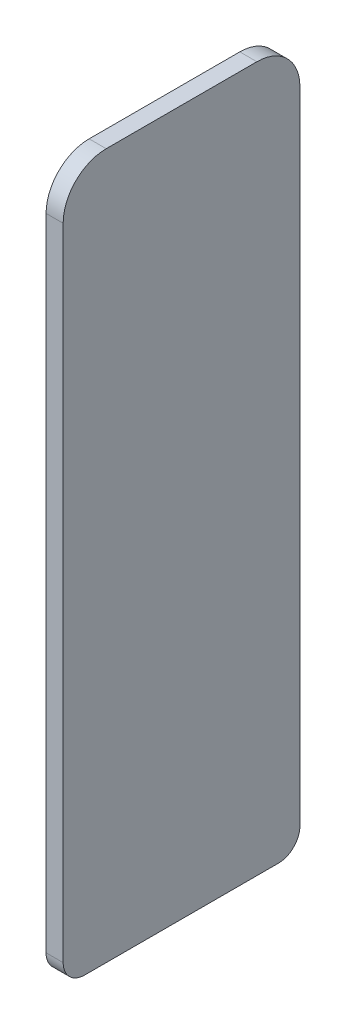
ISO-10303-21;
HEADER;
FILE_DESCRIPTION(('STEP AP214'),'2;1');
FILE_NAME('part.step','',(''),(''),'','','');
FILE_SCHEMA(('AUTOMOTIVE_DESIGN { 1 0 10303 214 1 1 1 1 }'));
ENDSEC;
DATA;
#1=APPLICATION_CONTEXT('core data for automotive mechanical design processes');
#2=APPLICATION_PROTOCOL_DEFINITION('international standard','automotive_design',2000,#1);
#3=PRODUCT_CONTEXT('',#1,'mechanical');
#4=PRODUCT('Part','Part','',(#3));
#5=PRODUCT_RELATED_PRODUCT_CATEGORY('part','',(#4));
#6=PRODUCT_DEFINITION_FORMATION('','',#4);
#7=PRODUCT_DEFINITION_CONTEXT('part definition',#1,'design');
#8=PRODUCT_DEFINITION('design','',#6,#7);
#9=PRODUCT_DEFINITION_SHAPE('','',#8);
#10=(LENGTH_UNIT() NAMED_UNIT(*) SI_UNIT(.MILLI.,.METRE.));
#11=(NAMED_UNIT(*) PLANE_ANGLE_UNIT() SI_UNIT($,.RADIAN.));
#12=(NAMED_UNIT(*) SI_UNIT($,.STERADIAN.) SOLID_ANGLE_UNIT());
#13=UNCERTAINTY_MEASURE_WITH_UNIT(LENGTH_MEASURE(1.E-05),#10,'distance_accuracy_value','');
#14=(GEOMETRIC_REPRESENTATION_CONTEXT(3) GLOBAL_UNCERTAINTY_ASSIGNED_CONTEXT((#13)) GLOBAL_UNIT_ASSIGNED_CONTEXT((#10,
#11,#12)) REPRESENTATION_CONTEXT('',''));
#15=CARTESIAN_POINT('',(0.,0.,0.));
#16=DIRECTION('',(0.,0.,1.));
#17=DIRECTION('',(1.,0.,0.));
#18=AXIS2_PLACEMENT_3D('',#15,#16,#17);
#19=CARTESIAN_POINT('',(-0.00101211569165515,229.277240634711,6.99999999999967));
#20=DIRECTION('',(1.,2.94105018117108E-13,0.));
#21=DIRECTION('',(-2.94105018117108E-13,1.,0.));
#22=AXIS2_PLACEMENT_3D('',#19,#20,#21);
#23=PLANE('',#22);
#24=CARTESIAN_POINT('',(-0.00101211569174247,229.277240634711,-7.00000000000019));
#25=DIRECTION('',(-1.,-2.94105018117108E-13,0.));
#26=DIRECTION('',(2.94105018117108E-13,-1.,0.));
#27=AXIS2_PLACEMENT_3D('',#24,#25,#26);
#28=CIRCLE('',#27,4.);
#29=CARTESIAN_POINT('',(-0.00101211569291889,233.277240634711,-7.00000000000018));
#30=VERTEX_POINT('',#29);
#31=CARTESIAN_POINT('',(-0.00101211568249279,229.277240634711,-11.0000000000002));
#32=VERTEX_POINT('',#31);
#33=EDGE_CURVE('E112',#30,#32,#28,.T.);
#34=ORIENTED_EDGE('',*,*,#33,.F.);
#35=DIRECTION('',(0.,0.,1.));
#36=VECTOR('',#35,1.);
#37=CARTESIAN_POINT('',(-0.00101211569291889,233.277240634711,-7.00000000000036));
#38=LINE('',#37,#36);
#39=CARTESIAN_POINT('',(-0.00101211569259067,233.277240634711,6.99999999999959));
#40=VERTEX_POINT('',#39);
#41=EDGE_CURVE('E105',#30,#40,#38,.T.);
#42=ORIENTED_EDGE('',*,*,#41,.T.);
#43=CARTESIAN_POINT('',(-0.00101211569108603,229.277240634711,6.99999999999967));
#44=DIRECTION('',(-1.,-2.94105018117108E-13,0.));
#45=DIRECTION('',(2.94105018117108E-13,-1.,0.));
#46=AXIS2_PLACEMENT_3D('',#43,#44,#45);
#47=CIRCLE('',#46,4.);
#48=CARTESIAN_POINT('',(-0.00101211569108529,229.277240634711,10.9999999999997));
#49=VERTEX_POINT('',#48);
#50=EDGE_CURVE('E91',#49,#40,#47,.T.);
#51=ORIENTED_EDGE('',*,*,#50,.F.);
#52=DIRECTION('',(0.,1.,0.));
#53=VECTOR('',#52,1.);
#54=CARTESIAN_POINT('',(-0.00101211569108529,229.277240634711,10.9999999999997));
#55=LINE('',#54,#53);
#56=CARTESIAN_POINT('',(-0.00101211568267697,169.777240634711,10.9999999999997));
#57=VERTEX_POINT('',#56);
#58=EDGE_CURVE('E88',#49,#57,#55,.F.);
#59=ORIENTED_EDGE('',*,*,#58,.T.);
#60=CARTESIAN_POINT('',(-0.00101211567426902,169.777240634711,8.99999999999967));
#61=DIRECTION('',(-1.,-2.94105018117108E-13,0.));
#62=DIRECTION('',(2.94105018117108E-13,-1.,0.));
#63=AXIS2_PLACEMENT_3D('',#60,#61,#62);
#64=CIRCLE('',#63,2.);
#65=CARTESIAN_POINT('',(-0.00101211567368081,167.777240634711,8.99999999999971));
#66=VERTEX_POINT('',#65);
#67=EDGE_CURVE('E20',#66,#57,#64,.T.);
#68=ORIENTED_EDGE('',*,*,#67,.F.);
#69=DIRECTION('',(0.,0.,1.));
#70=VECTOR('',#69,1.);
#71=CARTESIAN_POINT('',(-0.00101211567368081,167.777240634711,8.99999999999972));
#72=LINE('',#71,#70);
#73=CARTESIAN_POINT('',(-0.00101211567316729,167.777240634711,-9.00000000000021));
#74=VERTEX_POINT('',#73);
#75=EDGE_CURVE('E100',#66,#74,#72,.F.);
#76=ORIENTED_EDGE('',*,*,#75,.T.);
#77=CARTESIAN_POINT('',(-0.00101211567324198,169.777240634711,-9.00000000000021));
#78=DIRECTION('',(-1.,-2.94105018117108E-13,0.));
#79=DIRECTION('',(2.94105018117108E-13,-1.,0.));
#80=AXIS2_PLACEMENT_3D('',#77,#78,#79);
#81=CIRCLE('',#80,2.);
#82=CARTESIAN_POINT('',(-0.00101211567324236,169.777240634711,-11.0000000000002));
#83=VERTEX_POINT('',#82);
#84=EDGE_CURVE('E114',#83,#74,#81,.T.);
#85=ORIENTED_EDGE('',*,*,#84,.F.);
#86=DIRECTION('',(0.,-1.,0.));
#87=VECTOR('',#86,1.);
#88=CARTESIAN_POINT('',(-0.00101211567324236,169.777240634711,-11.0000000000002));
#89=LINE('',#88,#87);
#90=EDGE_CURVE('E109',#83,#32,#89,.F.);
#91=ORIENTED_EDGE('',*,*,#90,.T.);
#92=EDGE_LOOP('',(#34,#42,#51,#59,#68,#76,#85,#91));
#93=FACE_BOUND('',#92,.T.);
#94=ADVANCED_FACE('F17',(#93),#23,.T.);
#95=CARTESIAN_POINT('',(-0.00101211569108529,229.277240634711,10.9999999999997));
#96=DIRECTION('',(0.,0.,-1.));
#97=DIRECTION('',(0.,1.,0.));
#98=AXIS2_PLACEMENT_3D('',#95,#96,#97);
#99=PLANE('',#98);
#100=DIRECTION('',(-1.,-2.94105018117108E-13,0.));
#101=VECTOR('',#100,1.);
#102=CARTESIAN_POINT('',(-0.00101211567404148,169.777240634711,10.9999999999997));
#103=LINE('',#102,#101);
#104=CARTESIAN_POINT('',(-1.58851211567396,169.777240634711,10.9999999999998));
#105=VERTEX_POINT('',#104);
#106=EDGE_CURVE('E85',#57,#105,#103,.T.);
#107=ORIENTED_EDGE('',*,*,#106,.F.);
#108=ORIENTED_EDGE('',*,*,#58,.F.);
#109=DIRECTION('',(-1.,-2.94105018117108E-13,0.));
#110=VECTOR('',#109,1.);
#111=CARTESIAN_POINT('',(-0.0010121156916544,229.277240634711,10.9999999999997));
#112=LINE('',#111,#110);
#113=CARTESIAN_POINT('',(-1.58851211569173,229.27724063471,10.9999999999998));
#114=VERTEX_POINT('',#113);
#115=EDGE_CURVE('E106',#114,#49,#112,.F.);
#116=ORIENTED_EDGE('',*,*,#115,.F.);
#117=DIRECTION('',(-2.94105018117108E-13,1.,0.));
#118=VECTOR('',#117,1.);
#119=CARTESIAN_POINT('',(-1.58851211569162,229.277240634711,11.));
#120=LINE('',#119,#118);
#121=EDGE_CURVE('E98',#114,#105,#120,.F.);
#122=ORIENTED_EDGE('',*,*,#121,.T.);
#123=EDGE_LOOP('',(#107,#108,#116,#122));
#124=FACE_BOUND('',#123,.T.);
#125=ADVANCED_FACE('F97',(#124),#99,.F.);
#126=CARTESIAN_POINT('',(-0.00101211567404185,169.777240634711,8.99999999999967));
#127=DIRECTION('',(-1.,-2.94105018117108E-13,0.));
#128=DIRECTION('',(2.94105018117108E-13,-1.,0.));
#129=AXIS2_PLACEMENT_3D('',#126,#127,#128);
#130=CYLINDRICAL_SURFACE('',#129,2.);
#131=ORIENTED_EDGE('',*,*,#67,.T.);
#132=ORIENTED_EDGE('',*,*,#106,.T.);
#133=CARTESIAN_POINT('',(-1.58851211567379,169.777240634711,8.99999999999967));
#134=DIRECTION('',(-1.,-2.94105018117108E-13,0.));
#135=DIRECTION('',(2.94105018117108E-13,-1.,0.));
#136=AXIS2_PLACEMENT_3D('',#133,#134,#135);
#137=CIRCLE('',#136,2.);
#138=CARTESIAN_POINT('',(-1.58851211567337,167.777240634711,8.99999999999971));
#139=VERTEX_POINT('',#138);
#140=EDGE_CURVE('E124',#105,#139,#137,.F.);
#141=ORIENTED_EDGE('',*,*,#140,.T.);
#142=DIRECTION('',(-1.,-2.94021751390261E-13,0.));
#143=VECTOR('',#142,1.);
#144=CARTESIAN_POINT('',(-0.00101211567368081,167.777240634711,8.99999999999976));
#145=LINE('',#144,#143);
#146=EDGE_CURVE('E87',#139,#66,#145,.F.);
#147=ORIENTED_EDGE('',*,*,#146,.T.);
#148=EDGE_LOOP('',(#131,#132,#141,#147));
#149=FACE_BOUND('',#148,.T.);
#150=ADVANCED_FACE('F82',(#149),#130,.T.);
#151=CARTESIAN_POINT('',(-0.00101211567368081,167.777240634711,8.99999999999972));
#152=DIRECTION('',(-2.94021751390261E-13,1.,0.));
#153=DIRECTION('',(-1.,-2.94021751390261E-13,0.));
#154=AXIS2_PLACEMENT_3D('',#151,#152,#153);
#155=PLANE('',#154);
#156=DIRECTION('',(-1.,-2.94105018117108E-13,0.));
#157=VECTOR('',#156,1.);
#158=CARTESIAN_POINT('',(-0.0010121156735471,167.777240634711,-9.00000000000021));
#159=LINE('',#158,#157);
#160=CARTESIAN_POINT('',(-1.5885121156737,167.777240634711,-9.00000000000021));
#161=VERTEX_POINT('',#160);
#162=EDGE_CURVE('E103',#74,#161,#159,.T.);
#163=ORIENTED_EDGE('',*,*,#162,.F.);
#164=ORIENTED_EDGE('',*,*,#75,.F.);
#165=ORIENTED_EDGE('',*,*,#146,.F.);
#166=DIRECTION('',(0.,0.,1.));
#167=VECTOR('',#166,1.);
#168=CARTESIAN_POINT('',(-1.58851211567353,167.777240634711,6.9999999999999));
#169=LINE('',#168,#167);
#170=EDGE_CURVE('E123',#139,#161,#169,.F.);
#171=ORIENTED_EDGE('',*,*,#170,.T.);
#172=EDGE_LOOP('',(#163,#164,#165,#171));
#173=FACE_BOUND('',#172,.T.);
#174=ADVANCED_FACE('F162',(#173),#155,.F.);
#175=CARTESIAN_POINT('',(-0.00101211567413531,169.777240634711,-9.00000000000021));
#176=DIRECTION('',(-1.,-2.94105018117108E-13,0.));
#177=DIRECTION('',(2.94105018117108E-13,-1.,0.));
#178=AXIS2_PLACEMENT_3D('',#175,#176,#177);
#179=CYLINDRICAL_SURFACE('',#178,2.);
#180=ORIENTED_EDGE('',*,*,#84,.T.);
#181=ORIENTED_EDGE('',*,*,#162,.T.);
#182=CARTESIAN_POINT('',(-1.58851211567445,169.777240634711,-9.00000000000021));
#183=DIRECTION('',(-1.,-2.94105018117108E-13,0.));
#184=DIRECTION('',(2.94105018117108E-13,-1.,0.));
#185=AXIS2_PLACEMENT_3D('',#182,#183,#184);
#186=CIRCLE('',#185,2.);
#187=CARTESIAN_POINT('',(-1.58851211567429,169.777240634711,-11.0000000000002));
#188=VERTEX_POINT('',#187);
#189=EDGE_CURVE('E120',#161,#188,#186,.F.);
#190=ORIENTED_EDGE('',*,*,#189,.T.);
#191=DIRECTION('',(1.,0.,0.));
#192=VECTOR('',#191,1.);
#193=CARTESIAN_POINT('',(-0.00101211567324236,169.77724063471,-11.0000000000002));
#194=LINE('',#193,#192);
#195=EDGE_CURVE('E113',#188,#83,#194,.T.);
#196=ORIENTED_EDGE('',*,*,#195,.T.);
#197=EDGE_LOOP('',(#180,#181,#190,#196));
#198=FACE_BOUND('',#197,.T.);
#199=ADVANCED_FACE('F160',(#198),#179,.T.);
#200=CARTESIAN_POINT('',(-0.00101211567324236,169.777240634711,-11.0000000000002));
#201=DIRECTION('',(0.,0.,1.));
#202=DIRECTION('',(0.,-1.,0.));
#203=AXIS2_PLACEMENT_3D('',#200,#201,#202);
#204=PLANE('',#203);
#205=DIRECTION('',(-1.,-2.94105018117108E-13,0.));
#206=VECTOR('',#205,1.);
#207=CARTESIAN_POINT('',(-0.00101211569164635,229.27724063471,-11.0000000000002));
#208=LINE('',#207,#206);
#209=CARTESIAN_POINT('',(-1.5885121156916,229.27724063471,-11.0000000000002));
#210=VERTEX_POINT('',#209);
#211=EDGE_CURVE('E128',#32,#210,#208,.T.);
#212=ORIENTED_EDGE('',*,*,#211,.F.);
#213=ORIENTED_EDGE('',*,*,#90,.F.);
#214=ORIENTED_EDGE('',*,*,#195,.F.);
#215=DIRECTION('',(-2.94105018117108E-13,1.,0.));
#216=VECTOR('',#215,1.);
#217=CARTESIAN_POINT('',(-1.58851211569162,229.277240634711,-11.0000000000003));
#218=LINE('',#217,#216);
#219=EDGE_CURVE('E119',#188,#210,#218,.T.);
#220=ORIENTED_EDGE('',*,*,#219,.T.);
#221=EDGE_LOOP('',(#212,#213,#214,#220));
#222=FACE_BOUND('',#221,.T.);
#223=ADVANCED_FACE('F158',(#222),#204,.F.);
#224=CARTESIAN_POINT('',(-0.0010121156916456,229.277240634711,-7.00000000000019));
#225=DIRECTION('',(-1.,-2.94105018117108E-13,0.));
#226=DIRECTION('',(2.94105018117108E-13,-1.,0.));
#227=AXIS2_PLACEMENT_3D('',#224,#225,#226);
#228=CYLINDRICAL_SURFACE('',#227,4.);
#229=ORIENTED_EDGE('',*,*,#33,.T.);
#230=ORIENTED_EDGE('',*,*,#211,.T.);
#231=CARTESIAN_POINT('',(-1.58851211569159,229.277240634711,-7.00000000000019));
#232=DIRECTION('',(-1.,-2.94105018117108E-13,0.));
#233=DIRECTION('',(2.94105018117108E-13,-1.,0.));
#234=AXIS2_PLACEMENT_3D('',#231,#232,#233);
#235=CIRCLE('',#234,4.);
#236=CARTESIAN_POINT('',(-1.58851211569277,233.277240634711,-7.00000000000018));
#237=VERTEX_POINT('',#236);
#238=EDGE_CURVE('E116',#210,#237,#235,.F.);
#239=ORIENTED_EDGE('',*,*,#238,.T.);
#240=DIRECTION('',(1.,2.94105018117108E-13,0.));
#241=VECTOR('',#240,1.);
#242=CARTESIAN_POINT('',(-0.00101211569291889,233.277240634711,-7.00000000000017));
#243=LINE('',#242,#241);
#244=EDGE_CURVE('E107',#237,#30,#243,.T.);
#245=ORIENTED_EDGE('',*,*,#244,.T.);
#246=EDGE_LOOP('',(#229,#230,#239,#245));
#247=FACE_BOUND('',#246,.T.);
#248=ADVANCED_FACE('F154',(#247),#228,.T.);
#249=CARTESIAN_POINT('',(-0.00101211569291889,233.277240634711,-7.00000000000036));
#250=DIRECTION('',(2.94105018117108E-13,-1.,0.));
#251=DIRECTION('',(1.,2.94105018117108E-13,0.));
#252=AXIS2_PLACEMENT_3D('',#249,#250,#251);
#253=PLANE('',#252);
#254=DIRECTION('',(-1.,-2.94105018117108E-13,0.));
#255=VECTOR('',#254,1.);
#256=CARTESIAN_POINT('',(-0.00101211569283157,233.277240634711,6.9999999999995));
#257=LINE('',#256,#255);
#258=CARTESIAN_POINT('',(-1.58851211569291,233.277240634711,6.99999999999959));
#259=VERTEX_POINT('',#258);
#260=EDGE_CURVE('E34',#40,#259,#257,.T.);
#261=ORIENTED_EDGE('',*,*,#260,.F.);
#262=ORIENTED_EDGE('',*,*,#41,.F.);
#263=ORIENTED_EDGE('',*,*,#244,.F.);
#264=DIRECTION('',(0.,0.,1.));
#265=VECTOR('',#264,1.);
#266=CARTESIAN_POINT('',(-1.5885121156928,233.277240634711,6.9999999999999));
#267=LINE('',#266,#265);
#268=EDGE_CURVE('E26',#237,#259,#267,.T.);
#269=ORIENTED_EDGE('',*,*,#268,.T.);
#270=EDGE_LOOP('',(#261,#262,#263,#269));
#271=FACE_BOUND('',#270,.T.);
#272=ADVANCED_FACE('F147',(#271),#253,.F.);
#273=CARTESIAN_POINT('',(-0.00101211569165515,229.277240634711,6.99999999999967));
#274=DIRECTION('',(-1.,-2.94105018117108E-13,0.));
#275=DIRECTION('',(2.94105018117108E-13,-1.,0.));
#276=AXIS2_PLACEMENT_3D('',#273,#274,#275);
#277=CYLINDRICAL_SURFACE('',#276,4.);
#278=ORIENTED_EDGE('',*,*,#50,.T.);
#279=ORIENTED_EDGE('',*,*,#260,.T.);
#280=CARTESIAN_POINT('',(-1.58851211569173,229.277240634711,6.99999999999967));
#281=DIRECTION('',(-1.,-2.94105018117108E-13,0.));
#282=DIRECTION('',(2.94105018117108E-13,-1.,0.));
#283=AXIS2_PLACEMENT_3D('',#280,#281,#282);
#284=CIRCLE('',#283,4.);
#285=EDGE_CURVE('E10',#259,#114,#284,.F.);
#286=ORIENTED_EDGE('',*,*,#285,.T.);
#287=ORIENTED_EDGE('',*,*,#115,.T.);
#288=EDGE_LOOP('',(#278,#279,#286,#287));
#289=FACE_BOUND('',#288,.T.);
#290=ADVANCED_FACE('F173',(#289),#277,.T.);
#291=CARTESIAN_POINT('',(-1.58851211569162,229.277240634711,6.9999999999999));
#292=DIRECTION('',(1.,2.94105018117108E-13,0.));
#293=DIRECTION('',(-2.94105018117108E-13,1.,0.));
#294=AXIS2_PLACEMENT_3D('',#291,#292,#293);
#295=PLANE('',#294);
#296=ORIENTED_EDGE('',*,*,#268,.F.);
#297=ORIENTED_EDGE('',*,*,#238,.F.);
#298=ORIENTED_EDGE('',*,*,#219,.F.);
#299=ORIENTED_EDGE('',*,*,#189,.F.);
#300=ORIENTED_EDGE('',*,*,#170,.F.);
#301=ORIENTED_EDGE('',*,*,#140,.F.);
#302=ORIENTED_EDGE('',*,*,#121,.F.);
#303=ORIENTED_EDGE('',*,*,#285,.F.);
#304=EDGE_LOOP('',(#296,#297,#298,#299,#300,#301,#302,#303));
#305=FACE_BOUND('',#304,.T.);
#306=ADVANCED_FACE('F151',(#305),#295,.F.);
#307=CLOSED_SHELL('',(#94,#125,#150,#174,#199,#223,#248,#272,#290,#306));
#308=MANIFOLD_SOLID_BREP('B1',#307);
#309=ADVANCED_BREP_SHAPE_REPRESENTATION('',(#18,#308),#14);
#310=SHAPE_DEFINITION_REPRESENTATION(#9,#309);
ENDSEC;
END-ISO-10303-21;
